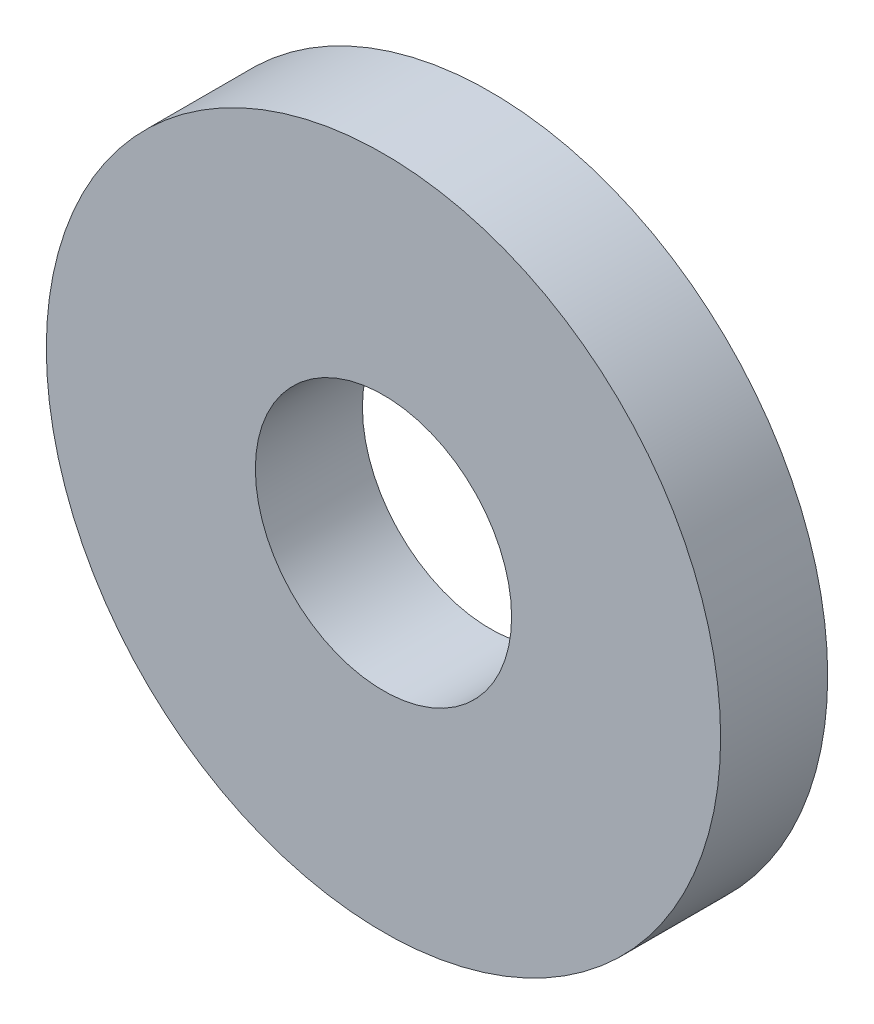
from build123d import *

# Parameters (mm, degrees)
SKETCH1_R           = 10
SKETCH1_R_2         = 3.8
BOSS_EXTRUDE1_DEPTH = 3.175


with BuildPart() as part:
    # Sketch1 → Boss-Extrude1 (new body)
    with BuildSketch(Plane.XY):
        with Locations((0, 190)):
            Circle(SKETCH1_R)
        with Locations((0, 190)):
            Circle(SKETCH1_R_2, mode=Mode.SUBTRACT)
    extrude(amount=BOSS_EXTRUDE1_DEPTH)


solid = part.part
